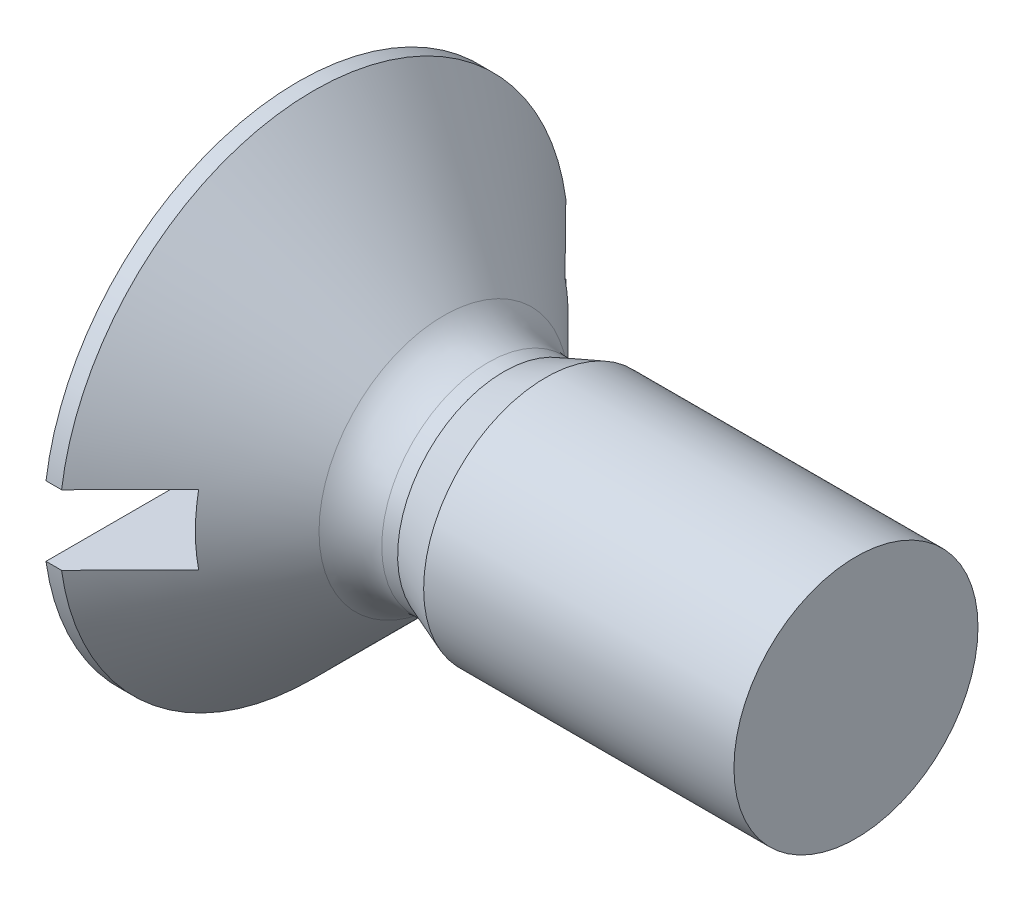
ISO-10303-21;
HEADER;
FILE_DESCRIPTION(('STEP AP214'),'2;1');
FILE_NAME('part.step','',(''),(''),'','','');
FILE_SCHEMA(('AUTOMOTIVE_DESIGN { 1 0 10303 214 1 1 1 1 }'));
ENDSEC;
DATA;
#1=APPLICATION_CONTEXT('core data for automotive mechanical design processes');
#2=APPLICATION_PROTOCOL_DEFINITION('international standard','automotive_design',2000,#1);
#3=PRODUCT_CONTEXT('',#1,'mechanical');
#4=PRODUCT('Part','Part','',(#3));
#5=PRODUCT_RELATED_PRODUCT_CATEGORY('part','',(#4));
#6=PRODUCT_DEFINITION_FORMATION('','',#4);
#7=PRODUCT_DEFINITION_CONTEXT('part definition',#1,'design');
#8=PRODUCT_DEFINITION('design','',#6,#7);
#9=PRODUCT_DEFINITION_SHAPE('','',#8);
#10=(LENGTH_UNIT() NAMED_UNIT(*) SI_UNIT(.MILLI.,.METRE.));
#11=(NAMED_UNIT(*) PLANE_ANGLE_UNIT() SI_UNIT($,.RADIAN.));
#12=(NAMED_UNIT(*) SI_UNIT($,.STERADIAN.) SOLID_ANGLE_UNIT());
#13=UNCERTAINTY_MEASURE_WITH_UNIT(LENGTH_MEASURE(1.E-05),#10,'distance_accuracy_value','');
#14=(GEOMETRIC_REPRESENTATION_CONTEXT(3) GLOBAL_UNCERTAINTY_ASSIGNED_CONTEXT((#13)) GLOBAL_UNIT_ASSIGNED_CONTEXT((#10,
#11,#12)) REPRESENTATION_CONTEXT('',''));
#15=CARTESIAN_POINT('',(0.,0.,0.));
#16=DIRECTION('',(0.,0.,1.));
#17=DIRECTION('',(1.,0.,0.));
#18=AXIS2_PLACEMENT_3D('',#15,#16,#17);
#19=CARTESIAN_POINT('',(0.0125,0.5,0.));
#20=DIRECTION('',(0.,-1.,0.));
#21=DIRECTION('',(0.,0.,-1.));
#22=AXIS2_PLACEMENT_3D('',#19,#20,#21);
#23=PLANE('',#22);
#24=CARTESIAN_POINT('',(1.2000000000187,0.5,2.62607417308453));
#25=CARTESIAN_POINT('',(1.11880130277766,0.5,2.7087283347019));
#26=CARTESIAN_POINT('',(1.03753771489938,0.5,2.79131867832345));
#27=CARTESIAN_POINT('',(0.87490540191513,0.5,2.95639562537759));
#28=CARTESIAN_POINT('',(0.79353667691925,0.5,3.03888222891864));
#29=CARTESIAN_POINT('',(0.630718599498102,0.5,3.20377572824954));
#30=CARTESIAN_POINT('',(0.549269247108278,0.5,3.2861826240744));
#31=CARTESIAN_POINT('',(0.386304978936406,0.5,3.45093173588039));
#32=CARTESIAN_POINT('',(0.304790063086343,0.5,3.53327395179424));
#33=CARTESIAN_POINT('',(0.223250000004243,0.5,3.61559123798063));
#34=B_SPLINE_CURVE_WITH_KNOTS('',3,(#24,#25,#26,#27,#28,#29,#30,#31,#32,#33),.UNSPECIFIED.,.F.,
.F.,(4,2,2,2,4),(0.,0.34759800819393,0.69519565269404,1.04279314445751,1.39039099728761),.UNSPECIFIED.);
#35=CARTESIAN_POINT('',(1.20000000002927,0.5,2.62607417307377));
#36=VERTEX_POINT('',#35);
#37=CARTESIAN_POINT('',(0.223249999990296,0.5,3.61559123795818));
#38=VERTEX_POINT('',#37);
#39=EDGE_CURVE('E169',#36,#38,#34,.T.);
#40=ORIENTED_EDGE('',*,*,#39,.T.);
#41=DIRECTION('',(1.,0.,0.));
#42=VECTOR('',#41,1.);
#43=CARTESIAN_POINT('',(0.,0.5,3.61559123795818));
#44=LINE('',#43,#42);
#45=CARTESIAN_POINT('',(0.,0.5,3.61559123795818));
#46=VERTEX_POINT('',#45);
#47=EDGE_CURVE('E113',#46,#38,#44,.T.);
#48=ORIENTED_EDGE('',*,*,#47,.F.);
#49=DIRECTION('',(0.,0.,1.));
#50=VECTOR('',#49,1.);
#51=CARTESIAN_POINT('',(0.,0.5,3.61559123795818));
#52=LINE('',#51,#50);
#53=CARTESIAN_POINT('',(0.,0.5,-3.61559123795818));
#54=VERTEX_POINT('',#53);
#55=EDGE_CURVE('E108',#54,#46,#52,.T.);
#56=ORIENTED_EDGE('',*,*,#55,.F.);
#57=DIRECTION('',(1.,0.,0.));
#58=VECTOR('',#57,1.);
#59=CARTESIAN_POINT('',(0.,0.5,-3.61559123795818));
#60=LINE('',#59,#58);
#61=CARTESIAN_POINT('',(0.223249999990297,0.5,-3.61559123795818));
#62=VERTEX_POINT('',#61);
#63=EDGE_CURVE('E116',#54,#62,#60,.T.);
#64=ORIENTED_EDGE('',*,*,#63,.T.);
#65=CARTESIAN_POINT('',(0.223250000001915,0.499999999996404,-3.61559123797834));
#66=CARTESIAN_POINT('',(0.304790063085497,0.499999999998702,-3.53327395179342));
#67=CARTESIAN_POINT('',(0.386304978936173,0.49999999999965,-3.45093173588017));
#68=CARTESIAN_POINT('',(0.549269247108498,0.50000000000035,-3.28618262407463));
#69=CARTESIAN_POINT('',(0.630718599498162,0.5000000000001,-3.20377572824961));
#70=CARTESIAN_POINT('',(0.793536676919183,0.4999999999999,-3.03888222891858));
#71=CARTESIAN_POINT('',(0.874905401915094,0.49999999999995,-2.95639562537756));
#72=CARTESIAN_POINT('',(1.03753771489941,0.50000000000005,-2.79131867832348));
#73=CARTESIAN_POINT('',(1.11880130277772,0.5000000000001,-2.70872833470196));
#74=CARTESIAN_POINT('',(1.2000000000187,0.5,-2.62607417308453));
#75=B_SPLINE_CURVE_WITH_KNOTS('',3,(#65,#66,#67,#68,#69,#70,#71,#72,#73,#74),.UNSPECIFIED.,.F.,
.F.,(4,2,2,2,4),(0.,0.347597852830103,0.695195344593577,1.04279298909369,1.39039099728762),.UNSPECIFIED.);
#76=CARTESIAN_POINT('',(1.20000000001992,0.5,-2.62607417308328));
#77=VERTEX_POINT('',#76);
#78=EDGE_CURVE('E144',#62,#77,#75,.T.);
#79=ORIENTED_EDGE('',*,*,#78,.T.);
#80=DIRECTION('',(0.,0.,-1.));
#81=VECTOR('',#80,1.);
#82=CARTESIAN_POINT('',(1.2,0.5,0.));
#83=LINE('',#82,#81);
#84=EDGE_CURVE('E140',#77,#36,#83,.F.);
#85=ORIENTED_EDGE('',*,*,#84,.T.);
#86=EDGE_LOOP('',(#40,#48,#56,#64,#79,#85));
#87=FACE_BOUND('',#86,.T.);
#88=ADVANCED_FACE('F36',(#87),#23,.T.);
#89=CARTESIAN_POINT('',(0.0125,-0.5,0.));
#90=DIRECTION('',(0.,1.,0.));
#91=DIRECTION('',(0.,0.,1.));
#92=AXIS2_PLACEMENT_3D('',#89,#90,#91);
#93=PLANE('',#92);
#94=CARTESIAN_POINT('',(1.20000000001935,-0.5,-2.62607417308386));
#95=CARTESIAN_POINT('',(1.11880130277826,-0.5,-2.70872833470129));
#96=CARTESIAN_POINT('',(1.03753771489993,-0.5,-2.79131867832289));
#97=CARTESIAN_POINT('',(0.874905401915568,-0.5,-2.95639562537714));
#98=CARTESIAN_POINT('',(0.793536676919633,-0.5,-3.03888222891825));
#99=CARTESIAN_POINT('',(0.630718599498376,-0.5,-3.20377572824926));
#100=CARTESIAN_POINT('',(0.549269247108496,-0.5,-3.28618262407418));
#101=CARTESIAN_POINT('',(0.386304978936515,-0.5,-3.45093173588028));
#102=CARTESIAN_POINT('',(0.304790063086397,-0.5,-3.53327395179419));
#103=CARTESIAN_POINT('',(0.223250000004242,-0.5,-3.61559123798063));
#104=B_SPLINE_CURVE_WITH_KNOTS('',3,(#94,#95,#96,#97,#98,#99,#100,#101,#102,#103),.UNSPECIFIED.,
.F.,.F.,(4,2,2,2,4),(0.,0.347598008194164,0.695195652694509,1.04279314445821,1.39039099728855),.UNSPECIFIED.);
#105=CARTESIAN_POINT('',(1.20000000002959,-0.5,-2.62607417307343));
#106=VERTEX_POINT('',#105);
#107=CARTESIAN_POINT('',(0.223249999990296,-0.5,-3.61559123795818));
#108=VERTEX_POINT('',#107);
#109=EDGE_CURVE('E132',#106,#108,#104,.T.);
#110=ORIENTED_EDGE('',*,*,#109,.T.);
#111=DIRECTION('',(1.,0.,0.));
#112=VECTOR('',#111,1.);
#113=CARTESIAN_POINT('',(0.,-0.5,-3.61559123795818));
#114=LINE('',#113,#112);
#115=CARTESIAN_POINT('',(0.,-0.5,-3.61559123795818));
#116=VERTEX_POINT('',#115);
#117=EDGE_CURVE('E93',#116,#108,#114,.T.);
#118=ORIENTED_EDGE('',*,*,#117,.F.);
#119=DIRECTION('',(0.,0.,-1.));
#120=VECTOR('',#119,1.);
#121=CARTESIAN_POINT('',(0.,-0.5,-3.61559123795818));
#122=LINE('',#121,#120);
#123=CARTESIAN_POINT('',(0.,-0.5,3.61559123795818));
#124=VERTEX_POINT('',#123);
#125=EDGE_CURVE('E85',#124,#116,#122,.T.);
#126=ORIENTED_EDGE('',*,*,#125,.F.);
#127=DIRECTION('',(1.,0.,0.));
#128=VECTOR('',#127,1.);
#129=CARTESIAN_POINT('',(0.,-0.5,3.61559123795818));
#130=LINE('',#129,#128);
#131=CARTESIAN_POINT('',(0.223249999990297,-0.5,3.61559123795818));
#132=VERTEX_POINT('',#131);
#133=EDGE_CURVE('E90',#124,#132,#130,.T.);
#134=ORIENTED_EDGE('',*,*,#133,.T.);
#135=CARTESIAN_POINT('',(0.223250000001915,-0.499999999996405,3.61559123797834));
#136=CARTESIAN_POINT('',(0.304790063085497,-0.499999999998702,3.53327395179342));
#137=CARTESIAN_POINT('',(0.386304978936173,-0.49999999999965,3.45093173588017));
#138=CARTESIAN_POINT('',(0.549269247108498,-0.50000000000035,3.28618262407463));
#139=CARTESIAN_POINT('',(0.630718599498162,-0.5000000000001,3.20377572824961));
#140=CARTESIAN_POINT('',(0.793536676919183,-0.4999999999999,3.03888222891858));
#141=CARTESIAN_POINT('',(0.874905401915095,-0.49999999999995,2.95639562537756));
#142=CARTESIAN_POINT('',(1.03753771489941,-0.50000000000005,2.79131867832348));
#143=CARTESIAN_POINT('',(1.11880130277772,-0.5000000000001,2.70872833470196));
#144=CARTESIAN_POINT('',(1.2000000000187,-0.5,2.62607417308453));
#145=B_SPLINE_CURVE_WITH_KNOTS('',3,(#135,#136,#137,#138,#139,#140,#141,#142,#143,#144),
.UNSPECIFIED.,.F.,.F.,(4,2,2,2,4),(0.,0.347597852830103,0.695195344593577,1.04279298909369,
1.39039099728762),.UNSPECIFIED.);
#146=CARTESIAN_POINT('',(1.20000000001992,-0.5,2.62607417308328));
#147=VERTEX_POINT('',#146);
#148=EDGE_CURVE('E139',#132,#147,#145,.T.);
#149=ORIENTED_EDGE('',*,*,#148,.T.);
#150=DIRECTION('',(0.,0.,1.));
#151=VECTOR('',#150,1.);
#152=CARTESIAN_POINT('',(1.2,-0.5,0.));
#153=LINE('',#152,#151);
#154=EDGE_CURVE('E135',#147,#106,#153,.F.);
#155=ORIENTED_EDGE('',*,*,#154,.T.);
#156=EDGE_LOOP('',(#110,#118,#126,#134,#149,#155));
#157=FACE_BOUND('',#156,.T.);
#158=ADVANCED_FACE('F87',(#157),#93,.T.);
#159=CARTESIAN_POINT('',(1.2,0.,0.));
#160=DIRECTION('',(-1.,0.,0.));
#161=DIRECTION('',(0.,0.,1.));
#162=AXIS2_PLACEMENT_3D('',#159,#160,#161);
#163=PLANE('',#162);
#164=CARTESIAN_POINT('',(1.20000000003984,0.,0.));
#165=DIRECTION('',(-1.,0.,0.));
#166=DIRECTION('',(0.,0.,1.));
#167=AXIS2_PLACEMENT_3D('',#164,#165,#166);
#168=CIRCLE('',#167,2.67324999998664);
#169=EDGE_CURVE('E53',#77,#106,#168,.T.);
#170=ORIENTED_EDGE('',*,*,#169,.T.);
#171=ORIENTED_EDGE('',*,*,#154,.F.);
#172=CARTESIAN_POINT('',(1.20000000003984,0.,0.));
#173=DIRECTION('',(-1.,0.,0.));
#174=DIRECTION('',(0.,0.,1.));
#175=AXIS2_PLACEMENT_3D('',#172,#173,#174);
#176=CIRCLE('',#175,2.67324999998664);
#177=EDGE_CURVE('E119',#147,#36,#176,.T.);
#178=ORIENTED_EDGE('',*,*,#177,.T.);
#179=ORIENTED_EDGE('',*,*,#84,.F.);
#180=EDGE_LOOP('',(#170,#171,#178,#179));
#181=FACE_BOUND('',#180,.T.);
#182=ADVANCED_FACE('F163',(#181),#163,.T.);
#183=CARTESIAN_POINT('',(0.22324999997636,0.,0.));
#184=DIRECTION('',(-1.,0.,0.));
#185=DIRECTION('',(0.,0.,1.));
#186=AXIS2_PLACEMENT_3D('',#183,#184,#185);
#187=CONICAL_SURFACE('',#186,3.65000000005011,0.785398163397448);
#188=CARTESIAN_POINT('',(2.08639610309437,0.,0.));
#189=DIRECTION('',(-1.,0.,0.));
#190=DIRECTION('',(0.,0.,1.));
#191=AXIS2_PLACEMENT_3D('',#188,#189,#190);
#192=CIRCLE('',#191,1.78685389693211);
#193=CARTESIAN_POINT('',(2.08639610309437,0.,1.78685389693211));
#194=VERTEX_POINT('',#193);
#195=EDGE_CURVE('E45',#194,#194,#192,.T.);
#196=ORIENTED_EDGE('',*,*,#195,.T.);
#197=EDGE_LOOP('',(#196));
#198=FACE_BOUND('',#197,.T.);
#199=ORIENTED_EDGE('',*,*,#78,.F.);
#200=CARTESIAN_POINT('',(0.22324999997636,0.,0.));
#201=DIRECTION('',(-1.,0.,0.));
#202=DIRECTION('',(0.,1.,0.));
#203=AXIS2_PLACEMENT_3D('',#200,#201,#202);
#204=CIRCLE('',#203,3.65000000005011);
#205=EDGE_CURVE('E126',#62,#38,#204,.F.);
#206=ORIENTED_EDGE('',*,*,#205,.T.);
#207=ORIENTED_EDGE('',*,*,#39,.F.);
#208=ORIENTED_EDGE('',*,*,#177,.F.);
#209=ORIENTED_EDGE('',*,*,#148,.F.);
#210=CARTESIAN_POINT('',(0.22324999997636,0.,0.));
#211=DIRECTION('',(-1.,0.,0.));
#212=DIRECTION('',(0.,1.,0.));
#213=AXIS2_PLACEMENT_3D('',#210,#211,#212);
#214=CIRCLE('',#213,3.65000000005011);
#215=EDGE_CURVE('E104',#132,#108,#214,.F.);
#216=ORIENTED_EDGE('',*,*,#215,.T.);
#217=ORIENTED_EDGE('',*,*,#109,.F.);
#218=ORIENTED_EDGE('',*,*,#169,.F.);
#219=EDGE_LOOP('',(#199,#206,#207,#208,#209,#216,#217,#218));
#220=FACE_BOUND('',#219,.T.);
#221=ADVANCED_FACE('F158',(#198,#220),#187,.T.);
#222=CARTESIAN_POINT('',(2.83639610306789,0.,0.));
#223=DIRECTION('',(1.,0.,0.));
#224=DIRECTION('',(0.,0.,-1.));
#225=AXIS2_PLACEMENT_3D('',#222,#223,#224);
#226=CYLINDRICAL_SURFACE('',#225,1.52325);
#227=CARTESIAN_POINT('',(2.72279220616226,0.,0.));
#228=DIRECTION('',(-1.,0.,0.));
#229=DIRECTION('',(0.,0.,1.));
#230=AXIS2_PLACEMENT_3D('',#227,#228,#229);
#231=CIRCLE('',#230,1.52325);
#232=CARTESIAN_POINT('',(2.72279220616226,0.,1.52325));
#233=VERTEX_POINT('',#232);
#234=EDGE_CURVE('E12',#233,#233,#231,.F.);
#235=ORIENTED_EDGE('',*,*,#234,.T.);
#236=EDGE_LOOP('',(#235));
#237=FACE_BOUND('',#236,.T.);
#238=CARTESIAN_POINT('',(2.9500000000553,0.,0.));
#239=DIRECTION('',(1.,0.,0.));
#240=DIRECTION('',(0.,1.,0.));
#241=AXIS2_PLACEMENT_3D('',#238,#239,#240);
#242=CIRCLE('',#241,1.52325000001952);
#243=CARTESIAN_POINT('',(2.9500000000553,1.52325000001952,0.));
#244=VERTEX_POINT('',#243);
#245=EDGE_CURVE('E120',#244,#244,#242,.T.);
#246=ORIENTED_EDGE('',*,*,#245,.F.);
#247=EDGE_LOOP('',(#246));
#248=FACE_BOUND('',#247,.T.);
#249=ADVANCED_FACE('F162',(#237,#248),#226,.T.);
#250=CARTESIAN_POINT('',(3.54999999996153,0.,0.));
#251=DIRECTION('',(1.,0.,0.));
#252=DIRECTION('',(0.,0.,-1.));
#253=AXIS2_PLACEMENT_3D('',#250,#251,#252);
#254=CONICAL_SURFACE('',#253,1.74999999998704,0.361325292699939);
#255=ORIENTED_EDGE('',*,*,#245,.T.);
#256=EDGE_LOOP('',(#255));
#257=FACE_BOUND('',#256,.T.);
#258=CARTESIAN_POINT('',(3.55,0.,0.));
#259=DIRECTION('',(1.,0.,0.));
#260=DIRECTION('',(0.,0.,-1.));
#261=AXIS2_PLACEMENT_3D('',#258,#259,#260);
#262=CIRCLE('',#261,1.75);
#263=CARTESIAN_POINT('',(3.55,0.,-1.75));
#264=VERTEX_POINT('',#263);
#265=EDGE_CURVE('E220',#264,#264,#262,.T.);
#266=ORIENTED_EDGE('',*,*,#265,.F.);
#267=EDGE_LOOP('',(#266));
#268=FACE_BOUND('',#267,.T.);
#269=ADVANCED_FACE('F189',(#257,#268),#254,.T.);
#270=CARTESIAN_POINT('',(0.,0.,0.));
#271=DIRECTION('',(1.,0.,0.));
#272=DIRECTION('',(0.,1.,0.));
#273=AXIS2_PLACEMENT_3D('',#270,#271,#272);
#274=CYLINDRICAL_SURFACE('',#273,3.65);
#275=ORIENTED_EDGE('',*,*,#205,.F.);
#276=ORIENTED_EDGE('',*,*,#63,.F.);
#277=CARTESIAN_POINT('',(0.,0.,0.));
#278=DIRECTION('',(-1.,0.,0.));
#279=DIRECTION('',(0.,1.,0.));
#280=AXIS2_PLACEMENT_3D('',#277,#278,#279);
#281=CIRCLE('',#280,3.65);
#282=EDGE_CURVE('E105',#46,#54,#281,.T.);
#283=ORIENTED_EDGE('',*,*,#282,.F.);
#284=ORIENTED_EDGE('',*,*,#47,.T.);
#285=EDGE_LOOP('',(#275,#276,#283,#284));
#286=FACE_BOUND('',#285,.T.);
#287=ADVANCED_FACE('F185',(#286),#274,.T.);
#288=CARTESIAN_POINT('',(0.,0.,0.));
#289=DIRECTION('',(1.,0.,0.));
#290=DIRECTION('',(0.,1.,0.));
#291=AXIS2_PLACEMENT_3D('',#288,#289,#290);
#292=PLANE('',#291);
#293=ORIENTED_EDGE('',*,*,#282,.T.);
#294=ORIENTED_EDGE('',*,*,#55,.T.);
#295=EDGE_LOOP('',(#293,#294));
#296=FACE_BOUND('',#295,.T.);
#297=ADVANCED_FACE('F191',(#296),#292,.F.);
#298=CARTESIAN_POINT('',(0.,0.,0.));
#299=DIRECTION('',(1.,0.,0.));
#300=DIRECTION('',(0.,1.,0.));
#301=AXIS2_PLACEMENT_3D('',#298,#299,#300);
#302=CYLINDRICAL_SURFACE('',#301,3.65);
#303=ORIENTED_EDGE('',*,*,#215,.F.);
#304=ORIENTED_EDGE('',*,*,#133,.F.);
#305=CARTESIAN_POINT('',(0.,0.,0.));
#306=DIRECTION('',(-1.,0.,0.));
#307=DIRECTION('',(0.,1.,0.));
#308=AXIS2_PLACEMENT_3D('',#305,#306,#307);
#309=CIRCLE('',#308,3.65);
#310=EDGE_CURVE('E96',#116,#124,#309,.T.);
#311=ORIENTED_EDGE('',*,*,#310,.F.);
#312=ORIENTED_EDGE('',*,*,#117,.T.);
#313=EDGE_LOOP('',(#303,#304,#311,#312));
#314=FACE_BOUND('',#313,.T.);
#315=ADVANCED_FACE('F102',(#314),#302,.T.);
#316=CARTESIAN_POINT('',(0.,0.,0.));
#317=DIRECTION('',(1.,0.,0.));
#318=DIRECTION('',(0.,1.,0.));
#319=AXIS2_PLACEMENT_3D('',#316,#317,#318);
#320=PLANE('',#319);
#321=ORIENTED_EDGE('',*,*,#310,.T.);
#322=ORIENTED_EDGE('',*,*,#125,.T.);
#323=EDGE_LOOP('',(#321,#322));
#324=FACE_BOUND('',#323,.T.);
#325=ADVANCED_FACE('F98',(#324),#320,.F.);
#326=CARTESIAN_POINT('',(8.,0.,0.));
#327=DIRECTION('',(-1.,0.,0.));
#328=DIRECTION('',(0.,0.,1.));
#329=AXIS2_PLACEMENT_3D('',#326,#327,#328);
#330=CYLINDRICAL_SURFACE('',#329,1.75);
#331=CARTESIAN_POINT('',(8.,0.,0.));
#332=DIRECTION('',(1.,0.,0.));
#333=DIRECTION('',(0.,0.,-1.));
#334=AXIS2_PLACEMENT_3D('',#331,#332,#333);
#335=CIRCLE('',#334,1.75);
#336=CARTESIAN_POINT('',(8.,0.,-1.75));
#337=VERTEX_POINT('',#336);
#338=EDGE_CURVE('E100',#337,#337,#335,.T.);
#339=ORIENTED_EDGE('',*,*,#338,.F.);
#340=EDGE_LOOP('',(#339));
#341=FACE_BOUND('',#340,.T.);
#342=ORIENTED_EDGE('',*,*,#265,.T.);
#343=EDGE_LOOP('',(#342));
#344=FACE_BOUND('',#343,.T.);
#345=ADVANCED_FACE('F207',(#341,#344),#330,.T.);
#346=CARTESIAN_POINT('',(8.,0.,0.));
#347=DIRECTION('',(1.,0.,0.));
#348=DIRECTION('',(0.,0.,-1.));
#349=AXIS2_PLACEMENT_3D('',#346,#347,#348);
#350=PLANE('',#349);
#351=ORIENTED_EDGE('',*,*,#338,.T.);
#352=EDGE_LOOP('',(#351));
#353=FACE_BOUND('',#352,.T.);
#354=ADVANCED_FACE('F210',(#353),#350,.T.);
#355=CARTESIAN_POINT('',(2.72279220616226,0.,0.));
#356=DIRECTION('',(-1.,0.,0.));
#357=DIRECTION('',(0.,0.,1.));
#358=AXIS2_PLACEMENT_3D('',#355,#356,#357);
#359=TOROIDAL_SURFACE('',#358,2.42325,0.9);
#360=ORIENTED_EDGE('',*,*,#234,.F.);
#361=EDGE_LOOP('',(#360));
#362=FACE_BOUND('',#361,.T.);
#363=ORIENTED_EDGE('',*,*,#195,.F.);
#364=EDGE_LOOP('',(#363));
#365=FACE_BOUND('',#364,.T.);
#366=ADVANCED_FACE('F38',(#362,#365),#359,.F.);
#367=CLOSED_SHELL('',(#88,#158,#182,#221,#249,#269,#287,#297,#315,#325,#345,#354,#366));
#368=MANIFOLD_SOLID_BREP('B2',#367);
#369=ADVANCED_BREP_SHAPE_REPRESENTATION('',(#18,#368),#14);
#370=SHAPE_DEFINITION_REPRESENTATION(#9,#369);
ENDSEC;
END-ISO-10303-21;
